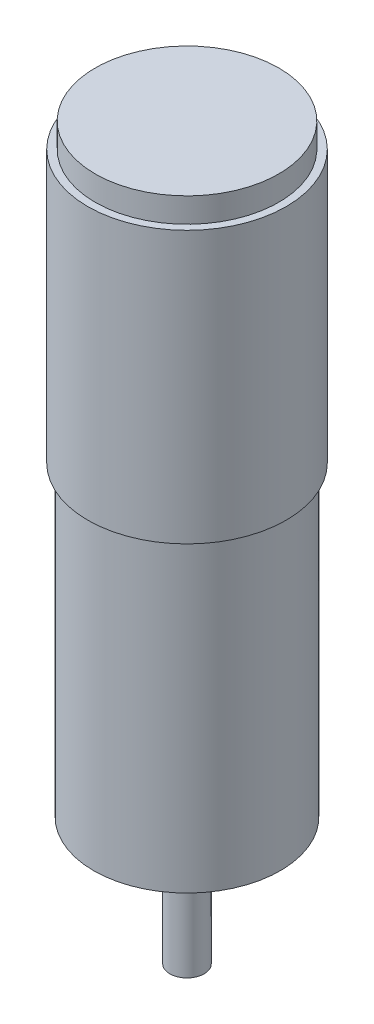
from build123d import *

# Parameters (mm, degrees)
SKETCH1_R           = 8.001
BASE_EXTRUDE_DEPTH  = 26.289
SKETCH2_R           = 8.509
BOSS_EXTRUDE1_DEPTH = 25.4
CUT_EXTRUDE1_START  = -2.1082
SKETCH3_R           = 8.509
SKETCH3_R_2         = 7.874
CUT_EXTRUDE1_DEPTH  = 2.1082
SKETCH5_R           = 2.96545
BOSS_EXTRUDE3_DEPTH = 0.762
SKETCH6_R           = 2.4765
BOSS_EXTRUDE4_DEPTH = 1.27
SKETCH7_R           = 1.4732
BOSS_EXTRUDE5_DEPTH = 8.89
SKETCH8_R           = 0.9652
CUT_EXTRUDE2_DEPTH  = 2.032


with BuildPart() as part:
    # Sketch1 → Base-Extrude (new body)
    with BuildSketch(Plane(origin=(0, 0, 0), x_dir=(1, 0, 0), z_dir=(0, 1, 0))):
        with Locations(Location((0, 0, 0), (0, 0, 270))):
            Circle(SKETCH1_R)
    extrude(amount=BASE_EXTRUDE_DEPTH)

    # Sketch2 → Boss-Extrude1 (add)
    with BuildSketch(Plane(origin=(0, 26.289, 0), x_dir=(-1, 0, 0), z_dir=(0, 1, 0))):
        with Locations(Location((0, 0, 0), (0, 0, 90))):
            Circle(SKETCH2_R)
    extrude(amount=BOSS_EXTRUDE1_DEPTH)

    # Sketch3 → Cut-Extrude1 (cut)
    with BuildSketch(Plane(origin=(0, 51.689, 0), x_dir=(-1, 0, 0), z_dir=(0, 1, 0)).offset(CUT_EXTRUDE1_START)):
        with Locations(Location((0, 0, 0), (0, 0, 90))):
            Circle(SKETCH3_R)
        with Locations(Location((0, 0, 0), (0, 0, 90))):
            Circle(SKETCH3_R_2, mode=Mode.SUBTRACT)
    extrude(amount=CUT_EXTRUDE1_DEPTH, mode=Mode.SUBTRACT)

    # Sketch5 → Boss-Extrude3 (add)
    with BuildSketch(Plane.XZ):
        with Locations(Location((0, 0, 0), (0, 0, 90))):
            Circle(SKETCH5_R)
    extrude(amount=BOSS_EXTRUDE3_DEPTH)

    # Sketch6 → Boss-Extrude4 (add)
    with BuildSketch(Plane.XZ.offset(0.762)):
        with Locations(Location((0, 0, 0), (0, 0, 270))):
            Circle(SKETCH6_R)
    extrude(amount=BOSS_EXTRUDE4_DEPTH)

    # Sketch7 → Boss-Extrude5 (add)
    with BuildSketch(Plane.XZ.offset(2.032)):
        with Locations(Location((0, 0, 0), (0, 0, 270))):
            Circle(SKETCH7_R)
    extrude(amount=BOSS_EXTRUDE5_DEPTH)

    # Sketch8 → Cut-Extrude2 (cut)
    with BuildSketch(Plane.XZ):
        with Locations(Location((0, 5.3975, 0), (0, 0, 270))):
            Circle(SKETCH8_R)
        with Locations(Location((0, -5.3975, 0), (0, 0, 270))):
            Circle(SKETCH8_R)
    extrude(amount=-CUT_EXTRUDE2_DEPTH, mode=Mode.SUBTRACT)


solid = part.part
